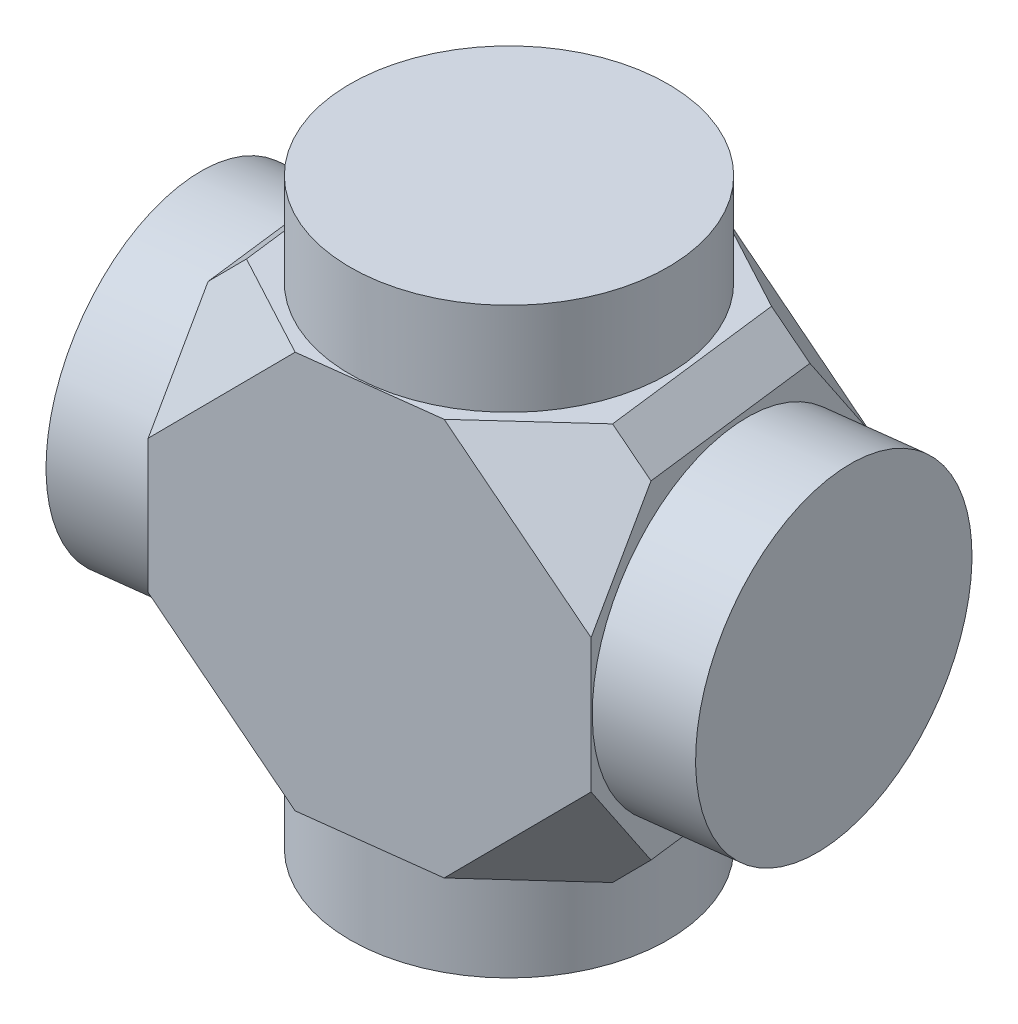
ISO-10303-21;
HEADER;
FILE_DESCRIPTION(('STEP AP214'),'2;1');
FILE_NAME('part.step','',(''),(''),'','','');
FILE_SCHEMA(('AUTOMOTIVE_DESIGN { 1 0 10303 214 1 1 1 1 }'));
ENDSEC;
DATA;
#1=APPLICATION_CONTEXT('core data for automotive mechanical design processes');
#2=APPLICATION_PROTOCOL_DEFINITION('international standard','automotive_design',2000,#1);
#3=PRODUCT_CONTEXT('',#1,'mechanical');
#4=PRODUCT('Part','Part','',(#3));
#5=PRODUCT_RELATED_PRODUCT_CATEGORY('part','',(#4));
#6=PRODUCT_DEFINITION_FORMATION('','',#4);
#7=PRODUCT_DEFINITION_CONTEXT('part definition',#1,'design');
#8=PRODUCT_DEFINITION('design','',#6,#7);
#9=PRODUCT_DEFINITION_SHAPE('','',#8);
#10=(LENGTH_UNIT() NAMED_UNIT(*) SI_UNIT(.MILLI.,.METRE.));
#11=(NAMED_UNIT(*) PLANE_ANGLE_UNIT() SI_UNIT($,.RADIAN.));
#12=(NAMED_UNIT(*) SI_UNIT($,.STERADIAN.) SOLID_ANGLE_UNIT());
#13=UNCERTAINTY_MEASURE_WITH_UNIT(LENGTH_MEASURE(1.E-05),#10,'distance_accuracy_value','');
#14=(GEOMETRIC_REPRESENTATION_CONTEXT(3) GLOBAL_UNCERTAINTY_ASSIGNED_CONTEXT((#13)) GLOBAL_UNIT_ASSIGNED_CONTEXT((#10,
#11,#12)) REPRESENTATION_CONTEXT('',''));
#15=CARTESIAN_POINT('',(0.,0.,0.));
#16=DIRECTION('',(0.,0.,1.));
#17=DIRECTION('',(1.,0.,0.));
#18=AXIS2_PLACEMENT_3D('',#15,#16,#17);
#19=CARTESIAN_POINT('',(99.9999999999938,11.,-148.379999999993));
#20=DIRECTION('',(0.,-1.,0.));
#21=DIRECTION('',(0.992460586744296,0.,-0.122564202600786));
#22=AXIS2_PLACEMENT_3D('',#19,#20,#21);
#23=CYLINDRICAL_SURFACE('',#22,6.);
#24=CARTESIAN_POINT('',(99.9999999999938,11.,-148.379999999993));
#25=DIRECTION('',(0.,1.,0.));
#26=DIRECTION('',(-0.992460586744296,0.,0.122564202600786));
#27=AXIS2_PLACEMENT_3D('',#24,#25,#26);
#28=CIRCLE('',#27,6.);
#29=CARTESIAN_POINT('',(94.045236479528,11.,-147.644614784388));
#30=VERTEX_POINT('',#29);
#31=EDGE_CURVE('E264',#30,#30,#28,.T.);
#32=ORIENTED_EDGE('',*,*,#31,.F.);
#33=EDGE_LOOP('',(#32));
#34=FACE_BOUND('',#33,.T.);
#35=CARTESIAN_POINT('',(99.9999999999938,7.5,-148.379999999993));
#36=DIRECTION('',(0.,-1.,0.));
#37=DIRECTION('',(0.992460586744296,0.,-0.122564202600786));
#38=AXIS2_PLACEMENT_3D('',#35,#36,#37);
#39=CIRCLE('',#38,6.);
#40=CARTESIAN_POINT('',(105.95476352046,7.5,-149.115385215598));
#41=VERTEX_POINT('',#40);
#42=EDGE_CURVE('E20',#41,#41,#39,.F.);
#43=ORIENTED_EDGE('',*,*,#42,.T.);
#44=EDGE_LOOP('',(#43));
#45=FACE_BOUND('',#44,.T.);
#46=ADVANCED_FACE('F16',(#34,#45),#23,.T.);
#47=CARTESIAN_POINT('',(99.9999999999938,11.,-148.379999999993));
#48=DIRECTION('',(0.,1.,0.));
#49=DIRECTION('',(-0.992460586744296,0.,0.122564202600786));
#50=AXIS2_PLACEMENT_3D('',#47,#48,#49);
#51=PLANE('',#50);
#52=ORIENTED_EDGE('',*,*,#31,.T.);
#53=EDGE_LOOP('',(#52));
#54=FACE_BOUND('',#53,.T.);
#55=ADVANCED_FACE('F344',(#54),#51,.T.);
#56=CARTESIAN_POINT('',(110.917066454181,0.,-149.728206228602));
#57=DIRECTION('',(0.992460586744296,0.,-0.122564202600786));
#58=DIRECTION('',(0.,1.,0.));
#59=AXIS2_PLACEMENT_3D('',#56,#57,#58);
#60=PLANE('',#59);
#61=CARTESIAN_POINT('',(110.917066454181,0.,-149.728206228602));
#62=DIRECTION('',(0.992460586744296,0.,-0.122564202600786));
#63=DIRECTION('',(0.,1.,0.));
#64=AXIS2_PLACEMENT_3D('',#61,#62,#63);
#65=CIRCLE('',#64,6.);
#66=CARTESIAN_POINT('',(110.917066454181,-6.,-149.728206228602));
#67=VERTEX_POINT('',#66);
#68=EDGE_CURVE('E252',#67,#67,#65,.T.);
#69=ORIENTED_EDGE('',*,*,#68,.T.);
#70=EDGE_LOOP('',(#69));
#71=FACE_BOUND('',#70,.T.);
#72=ADVANCED_FACE('F352',(#71),#60,.T.);
#73=CARTESIAN_POINT('',(89.0829335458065,0.,-147.031793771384));
#74=DIRECTION('',(0.992460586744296,0.,-0.122564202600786));
#75=DIRECTION('',(0.,1.,0.));
#76=AXIS2_PLACEMENT_3D('',#73,#74,#75);
#77=PLANE('',#76);
#78=CARTESIAN_POINT('',(89.0829335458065,0.,-147.031793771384));
#79=DIRECTION('',(0.992460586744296,0.,-0.122564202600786));
#80=DIRECTION('',(0.,1.,0.));
#81=AXIS2_PLACEMENT_3D('',#78,#79,#80);
#82=CIRCLE('',#81,6.);
#83=CARTESIAN_POINT('',(89.0829335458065,-6.,-147.031793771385));
#84=VERTEX_POINT('',#83);
#85=EDGE_CURVE('E259',#84,#84,#82,.T.);
#86=ORIENTED_EDGE('',*,*,#85,.F.);
#87=EDGE_LOOP('',(#86));
#88=FACE_BOUND('',#87,.T.);
#89=ADVANCED_FACE('F514',(#88),#77,.F.);
#90=CARTESIAN_POINT('',(110.917066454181,0.,-149.728206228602));
#91=DIRECTION('',(-0.992460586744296,0.,0.122564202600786));
#92=DIRECTION('',(0.,-1.,0.));
#93=AXIS2_PLACEMENT_3D('',#90,#91,#92);
#94=CYLINDRICAL_SURFACE('',#93,6.);
#95=CARTESIAN_POINT('',(107.443454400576,0.,-149.299231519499));
#96=DIRECTION('',(0.992460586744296,0.,-0.122564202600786));
#97=DIRECTION('',(0.,1.,0.));
#98=AXIS2_PLACEMENT_3D('',#95,#96,#97);
#99=CIRCLE('',#98,6.);
#100=CARTESIAN_POINT('',(107.443454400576,-6.,-149.299231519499));
#101=VERTEX_POINT('',#100);
#102=EDGE_CURVE('E249',#101,#101,#99,.F.);
#103=CARTESIAN_POINT('',(107.443454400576,-6.,-149.299231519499));
#104=CARTESIAN_POINT('',(107.479637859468,-6.,-149.303700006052));
#105=CARTESIAN_POINT('',(107.51582131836,-6.,-149.308168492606));
#106=CARTESIAN_POINT('',(107.588188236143,-6.,-149.317105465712));
#107=CARTESIAN_POINT('',(107.624371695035,-6.,-149.321573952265));
#108=CARTESIAN_POINT('',(107.696738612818,-6.,-149.330510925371));
#109=CARTESIAN_POINT('',(107.73292207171,-6.,-149.334979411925));
#110=CARTESIAN_POINT('',(107.805288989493,-6.,-149.343916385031));
#111=CARTESIAN_POINT('',(107.841472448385,-6.,-149.348384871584));
#112=CARTESIAN_POINT('',(107.913839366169,-6.,-149.35732184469));
#113=CARTESIAN_POINT('',(107.95002282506,-6.,-149.361790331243));
#114=CARTESIAN_POINT('',(108.022389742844,-6.,-149.37072730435));
#115=CARTESIAN_POINT('',(108.058573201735,-6.,-149.375195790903));
#116=CARTESIAN_POINT('',(108.130940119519,-6.,-149.384132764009));
#117=CARTESIAN_POINT('',(108.167123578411,-6.,-149.388601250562));
#118=CARTESIAN_POINT('',(108.239490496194,-6.,-149.397538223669));
#119=CARTESIAN_POINT('',(108.275673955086,-6.,-149.402006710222));
#120=CARTESIAN_POINT('',(108.348040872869,-6.,-149.410943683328));
#121=CARTESIAN_POINT('',(108.384224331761,-6.,-149.415412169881));
#122=CARTESIAN_POINT('',(108.456591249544,-6.,-149.424349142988));
#123=CARTESIAN_POINT('',(108.492774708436,-6.,-149.428817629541));
#124=CARTESIAN_POINT('',(108.565141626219,-6.,-149.437754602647));
#125=CARTESIAN_POINT('',(108.601325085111,-6.,-149.4422230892));
#126=CARTESIAN_POINT('',(108.673692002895,-6.,-149.451160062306));
#127=CARTESIAN_POINT('',(108.709875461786,-6.,-149.45562854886));
#128=CARTESIAN_POINT('',(108.78224237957,-6.,-149.464565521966));
#129=CARTESIAN_POINT('',(108.818425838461,-6.,-149.469034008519));
#130=CARTESIAN_POINT('',(108.890792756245,-6.,-149.477970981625));
#131=CARTESIAN_POINT('',(108.926976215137,-6.,-149.482439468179));
#132=CARTESIAN_POINT('',(108.99934313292,-6.,-149.491376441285));
#133=CARTESIAN_POINT('',(109.035526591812,-6.,-149.495844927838));
#134=CARTESIAN_POINT('',(109.107893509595,-6.,-149.504781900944));
#135=CARTESIAN_POINT('',(109.144076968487,-6.,-149.509250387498));
#136=CARTESIAN_POINT('',(109.21644388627,-6.,-149.518187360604));
#137=CARTESIAN_POINT('',(109.252627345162,-6.,-149.522655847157));
#138=CARTESIAN_POINT('',(109.324994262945,-6.,-149.531592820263));
#139=CARTESIAN_POINT('',(109.361177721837,-6.,-149.536061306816));
#140=CARTESIAN_POINT('',(109.433544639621,-6.,-149.544998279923));
#141=CARTESIAN_POINT('',(109.469728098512,-6.,-149.549466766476));
#142=CARTESIAN_POINT('',(109.542095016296,-6.,-149.558403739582));
#143=CARTESIAN_POINT('',(109.578278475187,-6.,-149.562872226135));
#144=CARTESIAN_POINT('',(109.650645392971,-6.,-149.571809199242));
#145=CARTESIAN_POINT('',(109.686828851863,-6.,-149.576277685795));
#146=CARTESIAN_POINT('',(109.759195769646,-6.,-149.585214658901));
#147=CARTESIAN_POINT('',(109.795379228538,-6.,-149.589683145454));
#148=CARTESIAN_POINT('',(109.867746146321,-6.,-149.598620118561));
#149=CARTESIAN_POINT('',(109.903929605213,-6.,-149.603088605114));
#150=CARTESIAN_POINT('',(109.976296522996,-6.,-149.61202557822));
#151=CARTESIAN_POINT('',(110.012479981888,-6.,-149.616494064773));
#152=CARTESIAN_POINT('',(110.084846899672,-6.,-149.625431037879));
#153=CARTESIAN_POINT('',(110.121030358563,-6.,-149.629899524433));
#154=CARTESIAN_POINT('',(110.193397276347,-6.,-149.638836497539));
#155=CARTESIAN_POINT('',(110.229580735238,-6.,-149.643304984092));
#156=CARTESIAN_POINT('',(110.301947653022,-6.,-149.652241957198));
#157=CARTESIAN_POINT('',(110.338131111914,-6.,-149.656710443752));
#158=CARTESIAN_POINT('',(110.410498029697,-6.,-149.665647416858));
#159=CARTESIAN_POINT('',(110.446681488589,-6.,-149.670115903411));
#160=CARTESIAN_POINT('',(110.519048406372,-6.,-149.679052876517));
#161=CARTESIAN_POINT('',(110.555231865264,-6.,-149.68352136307));
#162=CARTESIAN_POINT('',(110.627598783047,-6.,-149.692458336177));
#163=CARTESIAN_POINT('',(110.663782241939,-6.,-149.69692682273));
#164=CARTESIAN_POINT('',(110.736149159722,-6.,-149.705863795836));
#165=CARTESIAN_POINT('',(110.772332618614,-6.,-149.710332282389));
#166=CARTESIAN_POINT('',(110.844699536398,-6.,-149.719269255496));
#167=CARTESIAN_POINT('',(110.880882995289,-6.,-149.723737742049));
#168=CARTESIAN_POINT('',(110.917066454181,-6.,-149.728206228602));
#169=B_SPLINE_CURVE_WITH_KNOTS('',3,(#103,#104,#105,#106,#107,#108,#109,#110,#111,#112,#113,
#114,#115,#116,#117,#118,#119,#120,#121,#122,#123,#124,#125,#126,#127,#128,#129,#130,#131,#132,
#133,#134,#135,#136,#137,#138,#139,#140,#141,#142,#143,#144,#145,#146,#147,#148,#149,#150,#151,
#152,#153,#154,#155,#156,#157,#158,#159,#160,#161,#162,#163,#164,#165,#166,#167,#168),
.UNSPECIFIED.,.F.,.F.,(4,2,2,2,2,2,2,2,2,2,2,2,2,2,2,2,2,2,2,2,2,2,2,2,2,2,2,2,2,2,2,2,4),(0.,
0.109374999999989,0.218749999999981,0.328124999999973,0.437499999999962,0.546874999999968,
0.656249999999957,0.765624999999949,0.874999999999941,0.98437499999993,1.09374999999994,
1.20312499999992,1.31249999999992,1.42187499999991,1.53124999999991,1.6406249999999,
1.74999999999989,1.85937499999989,1.96874999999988,2.07812499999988,2.18749999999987,
2.29687499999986,2.40624999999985,2.51562499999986,2.62499999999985,2.73437499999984,
2.84374999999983,2.95312499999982,3.06249999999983,3.17187499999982,3.28124999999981,
3.3906249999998,3.49999999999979),.UNSPECIFIED.);
#170=EDGE_CURVE('BSEAM520',#101,#67,#169,.T.);
#171=ORIENTED_EDGE('',*,*,#102,.F.);
#172=ORIENTED_EDGE('',*,*,#68,.F.);
#173=ORIENTED_EDGE('',*,*,#170,.T.);
#174=ORIENTED_EDGE('',*,*,#170,.F.);
#175=EDGE_LOOP('',(#171,#173,#172,#174));
#176=FACE_BOUND('',#175,.T.);
#177=ADVANCED_FACE('F520',(#176),#94,.T.);
#178=CARTESIAN_POINT('',(92.5565455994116,0.,-147.460768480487));
#179=DIRECTION('',(0.992460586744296,0.,-0.122564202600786));
#180=DIRECTION('',(0.,1.,0.));
#181=AXIS2_PLACEMENT_3D('',#178,#179,#180);
#182=CIRCLE('',#181,6.);
#183=CARTESIAN_POINT('',(92.5565455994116,-6.,-147.460768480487));
#184=VERTEX_POINT('',#183);
#185=EDGE_CURVE('E248',#184,#184,#182,.F.);
#186=CARTESIAN_POINT('',(89.0829335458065,-6.,-147.031793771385));
#187=CARTESIAN_POINT('',(89.1191170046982,-6.,-147.036262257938));
#188=CARTESIAN_POINT('',(89.1553004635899,-6.,-147.040730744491));
#189=CARTESIAN_POINT('',(89.2276673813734,-6.,-147.049667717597));
#190=CARTESIAN_POINT('',(89.2638508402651,-6.,-147.05413620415));
#191=CARTESIAN_POINT('',(89.3362177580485,-6.,-147.063073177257));
#192=CARTESIAN_POINT('',(89.3724012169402,-6.,-147.06754166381));
#193=CARTESIAN_POINT('',(89.4447681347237,-6.,-147.076478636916));
#194=CARTESIAN_POINT('',(89.4809515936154,-6.,-147.080947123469));
#195=CARTESIAN_POINT('',(89.5533185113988,-6.,-147.089884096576));
#196=CARTESIAN_POINT('',(89.5895019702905,-6.,-147.094352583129));
#197=CARTESIAN_POINT('',(89.661868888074,-6.,-147.103289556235));
#198=CARTESIAN_POINT('',(89.6980523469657,-6.,-147.107758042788));
#199=CARTESIAN_POINT('',(89.7704192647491,-6.,-147.116695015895));
#200=CARTESIAN_POINT('',(89.8066027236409,-6.,-147.121163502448));
#201=CARTESIAN_POINT('',(89.8789696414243,-6.,-147.130100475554));
#202=CARTESIAN_POINT('',(89.915153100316,-6.,-147.134568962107));
#203=CARTESIAN_POINT('',(89.9875200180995,-6.,-147.143505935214));
#204=CARTESIAN_POINT('',(90.0237034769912,-6.,-147.147974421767));
#205=CARTESIAN_POINT('',(90.0960703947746,-6.,-147.156911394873));
#206=CARTESIAN_POINT('',(90.1322538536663,-6.,-147.161379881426));
#207=CARTESIAN_POINT('',(90.2046207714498,-6.,-147.170316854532));
#208=CARTESIAN_POINT('',(90.2408042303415,-6.,-147.174785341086));
#209=CARTESIAN_POINT('',(90.313171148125,-6.,-147.183722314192));
#210=CARTESIAN_POINT('',(90.3493546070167,-6.,-147.188190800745));
#211=CARTESIAN_POINT('',(90.4217215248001,-6.,-147.197127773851));
#212=CARTESIAN_POINT('',(90.4579049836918,-6.,-147.201596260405));
#213=CARTESIAN_POINT('',(90.5302719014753,-6.,-147.210533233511));
#214=CARTESIAN_POINT('',(90.566455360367,-6.,-147.215001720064));
#215=CARTESIAN_POINT('',(90.6388222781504,-6.,-147.22393869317));
#216=CARTESIAN_POINT('',(90.6750057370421,-6.,-147.228407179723));
#217=CARTESIAN_POINT('',(90.7473726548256,-6.,-147.23734415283));
#218=CARTESIAN_POINT('',(90.7835561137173,-6.,-147.241812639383));
#219=CARTESIAN_POINT('',(90.8559230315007,-6.,-147.250749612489));
#220=CARTESIAN_POINT('',(90.8921064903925,-6.,-147.255218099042));
#221=CARTESIAN_POINT('',(90.9644734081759,-6.,-147.264155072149));
#222=CARTESIAN_POINT('',(91.0006568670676,-6.,-147.268623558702));
#223=CARTESIAN_POINT('',(91.0730237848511,-6.,-147.277560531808));
#224=CARTESIAN_POINT('',(91.1092072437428,-6.,-147.282029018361));
#225=CARTESIAN_POINT('',(91.1815741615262,-6.,-147.290965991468));
#226=CARTESIAN_POINT('',(91.2177576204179,-6.,-147.295434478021));
#227=CARTESIAN_POINT('',(91.2901245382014,-6.,-147.304371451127));
#228=CARTESIAN_POINT('',(91.3263079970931,-6.,-147.30883993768));
#229=CARTESIAN_POINT('',(91.3986749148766,-6.,-147.317776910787));
#230=CARTESIAN_POINT('',(91.4348583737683,-6.,-147.32224539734));
#231=CARTESIAN_POINT('',(91.5072252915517,-6.,-147.331182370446));
#232=CARTESIAN_POINT('',(91.5434087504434,-6.,-147.335650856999));
#233=CARTESIAN_POINT('',(91.6157756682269,-6.,-147.344587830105));
#234=CARTESIAN_POINT('',(91.6519591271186,-6.,-147.349056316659));
#235=CARTESIAN_POINT('',(91.724326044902,-6.,-147.357993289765));
#236=CARTESIAN_POINT('',(91.7605095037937,-6.,-147.362461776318));
#237=CARTESIAN_POINT('',(91.8328764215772,-6.,-147.371398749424));
#238=CARTESIAN_POINT('',(91.8690598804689,-6.,-147.375867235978));
#239=CARTESIAN_POINT('',(91.9414267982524,-6.,-147.384804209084));
#240=CARTESIAN_POINT('',(91.9776102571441,-6.,-147.389272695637));
#241=CARTESIAN_POINT('',(92.0499771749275,-6.,-147.398209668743));
#242=CARTESIAN_POINT('',(92.0861606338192,-6.,-147.402678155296));
#243=CARTESIAN_POINT('',(92.1585275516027,-6.,-147.411615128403));
#244=CARTESIAN_POINT('',(92.1947110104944,-6.,-147.416083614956));
#245=CARTESIAN_POINT('',(92.2670779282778,-6.,-147.425020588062));
#246=CARTESIAN_POINT('',(92.3032613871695,-6.,-147.429489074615));
#247=CARTESIAN_POINT('',(92.375628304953,-6.,-147.438426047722));
#248=CARTESIAN_POINT('',(92.4118117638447,-6.,-147.442894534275));
#249=CARTESIAN_POINT('',(92.4841786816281,-6.,-147.451831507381));
#250=CARTESIAN_POINT('',(92.5203621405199,-6.,-147.456299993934));
#251=CARTESIAN_POINT('',(92.5565455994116,-6.,-147.460768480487));
#252=B_SPLINE_CURVE_WITH_KNOTS('',3,(#186,#187,#188,#189,#190,#191,#192,#193,#194,#195,#196,
#197,#198,#199,#200,#201,#202,#203,#204,#205,#206,#207,#208,#209,#210,#211,#212,#213,#214,#215,
#216,#217,#218,#219,#220,#221,#222,#223,#224,#225,#226,#227,#228,#229,#230,#231,#232,#233,#234,
#235,#236,#237,#238,#239,#240,#241,#242,#243,#244,#245,#246,#247,#248,#249,#250,#251),
.UNSPECIFIED.,.F.,.F.,(4,2,2,2,2,2,2,2,2,2,2,2,2,2,2,2,2,2,2,2,2,2,2,2,2,2,2,2,2,2,2,2,4),(0.,
0.109375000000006,0.218749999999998,0.328125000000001,0.437500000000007,0.546875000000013,
0.656250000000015,0.765625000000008,0.87500000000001,0.984375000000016,1.09375000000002,
1.20312500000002,1.31250000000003,1.42187500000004,1.53125000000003,1.64062500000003,
1.75000000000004,1.85937500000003,1.96875000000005,2.07812500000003,2.18750000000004,
2.29687500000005,2.40625000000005,2.51562500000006,2.62500000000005,2.73437500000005,
2.84375000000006,2.95312500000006,3.06250000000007,3.17187500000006,3.28125000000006,
3.39062500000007,3.50000000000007),.UNSPECIFIED.);
#253=EDGE_CURVE('BSEAM529',#84,#184,#252,.T.);
#254=ORIENTED_EDGE('',*,*,#85,.T.);
#255=ORIENTED_EDGE('',*,*,#185,.T.);
#256=ORIENTED_EDGE('',*,*,#253,.T.);
#257=ORIENTED_EDGE('',*,*,#253,.F.);
#258=EDGE_LOOP('',(#254,#256,#255,#257));
#259=FACE_BOUND('',#258,.T.);
#260=ADVANCED_FACE('F529',(#259),#94,.T.);
#261=CARTESIAN_POINT('',(108.184967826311,-7.5,-143.294844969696));
#262=DIRECTION('',(0.992460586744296,0.,-0.122564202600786));
#263=DIRECTION('',(0.,1.,0.));
#264=AXIS2_PLACEMENT_3D('',#261,#262,#263);
#265=PLANE('',#264);
#266=ORIENTED_EDGE('',*,*,#102,.T.);
#267=EDGE_LOOP('',(#266));
#268=FACE_BOUND('',#267,.T.);
#269=DIRECTION('',(-0.122564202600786,0.,-0.992460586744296));
#270=VECTOR('',#269,1.);
#271=CARTESIAN_POINT('',(106.701940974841,-6.2,-155.303618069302));
#272=LINE('',#271,#270);
#273=CARTESIAN_POINT('',(107.866300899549,-6.2,-145.875242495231));
#274=VERTEX_POINT('',#273);
#275=CARTESIAN_POINT('',(107.020607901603,-6.2,-152.723220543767));
#276=VERTEX_POINT('',#275);
#277=EDGE_CURVE('E182',#274,#276,#272,.T.);
#278=ORIENTED_EDGE('',*,*,#277,.T.);
#279=DIRECTION('',(-0.0707624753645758,0.816496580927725,-0.572997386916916));
#280=VECTOR('',#279,1.);
#281=CARTESIAN_POINT('',(107.483838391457,-11.5450096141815,-148.972223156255));
#282=LINE('',#281,#280);
#283=CARTESIAN_POINT('',(106.701940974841,-2.52304473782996,-155.303618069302));
#284=VERTEX_POINT('',#283);
#285=EDGE_CURVE('E232',#276,#284,#282,.T.);
#286=ORIENTED_EDGE('',*,*,#285,.T.);
#287=DIRECTION('',(0.,1.,0.));
#288=VECTOR('',#287,1.);
#289=CARTESIAN_POINT('',(106.701940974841,-7.5,-155.303618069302));
#290=LINE('',#289,#288);
#291=CARTESIAN_POINT('',(106.701940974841,2.52304473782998,-155.303618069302));
#292=VERTEX_POINT('',#291);
#293=EDGE_CURVE('E153',#284,#292,#290,.T.);
#294=ORIENTED_EDGE('',*,*,#293,.T.);
#295=DIRECTION('',(0.0707624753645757,0.816496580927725,0.572997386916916));
#296=VECTOR('',#295,1.);
#297=CARTESIAN_POINT('',(106.61717860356,1.5450096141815,-155.989979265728));
#298=LINE('',#297,#296);
#299=CARTESIAN_POINT('',(107.020607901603,6.2,-152.723220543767));
#300=VERTEX_POINT('',#299);
#301=EDGE_CURVE('E39',#292,#300,#298,.T.);
#302=ORIENTED_EDGE('',*,*,#301,.T.);
#303=DIRECTION('',(0.122564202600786,0.,0.992460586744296));
#304=VECTOR('',#303,1.);
#305=CARTESIAN_POINT('',(108.184967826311,6.2,-143.294844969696));
#306=LINE('',#305,#304);
#307=CARTESIAN_POINT('',(107.866300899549,6.2,-145.875242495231));
#308=VERTEX_POINT('',#307);
#309=EDGE_CURVE('E180',#300,#308,#306,.T.);
#310=ORIENTED_EDGE('',*,*,#309,.T.);
#311=DIRECTION('',(0.0707624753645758,-0.816496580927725,0.572997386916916));
#312=VECTOR('',#311,1.);
#313=CARTESIAN_POINT('',(108.764072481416,-4.15898508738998,-138.605559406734));
#314=LINE('',#313,#312);
#315=CARTESIAN_POINT('',(108.184967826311,2.52304473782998,-143.294844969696));
#316=VERTEX_POINT('',#315);
#317=EDGE_CURVE('E227',#308,#316,#314,.T.);
#318=ORIENTED_EDGE('',*,*,#317,.T.);
#319=DIRECTION('',(0.,-1.,0.));
#320=VECTOR('',#319,1.);
#321=CARTESIAN_POINT('',(108.184967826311,7.5,-143.294844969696));
#322=LINE('',#321,#320);
#323=CARTESIAN_POINT('',(108.184967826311,-2.52304473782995,-143.294844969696));
#324=VERTEX_POINT('',#323);
#325=EDGE_CURVE('E271',#316,#324,#322,.T.);
#326=ORIENTED_EDGE('',*,*,#325,.T.);
#327=DIRECTION('',(-0.0707624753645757,-0.816496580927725,-0.572997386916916));
#328=VECTOR('',#327,1.);
#329=CARTESIAN_POINT('',(107.897412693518,-5.84101491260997,-145.623315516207));
#330=LINE('',#329,#328);
#331=EDGE_CURVE('E229',#324,#274,#330,.T.);
#332=ORIENTED_EDGE('',*,*,#331,.T.);
#333=EDGE_LOOP('',(#278,#286,#294,#302,#310,#318,#326,#332));
#334=FACE_BOUND('',#333,.T.);
#335=ADVANCED_FACE('F318',(#268,#334),#265,.T.);
#336=CARTESIAN_POINT('',(93.2980590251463,-7.5,-141.456381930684));
#337=DIRECTION('',(0.992460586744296,0.,-0.122564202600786));
#338=DIRECTION('',(0.,1.,0.));
#339=AXIS2_PLACEMENT_3D('',#336,#337,#338);
#340=PLANE('',#339);
#341=ORIENTED_EDGE('',*,*,#185,.F.);
#342=EDGE_LOOP('',(#341));
#343=FACE_BOUND('',#342,.T.);
#344=DIRECTION('',(-0.122564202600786,0.,-0.992460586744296));
#345=VECTOR('',#344,1.);
#346=CARTESIAN_POINT('',(93.2980590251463,6.2,-141.456381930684));
#347=LINE('',#346,#345);
#348=CARTESIAN_POINT('',(92.9793920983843,6.2,-144.036779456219));
#349=VERTEX_POINT('',#348);
#350=CARTESIAN_POINT('',(92.1336991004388,6.2,-150.884757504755));
#351=VERTEX_POINT('',#350);
#352=EDGE_CURVE('E174',#349,#351,#347,.T.);
#353=ORIENTED_EDGE('',*,*,#352,.T.);
#354=DIRECTION('',(0.0707624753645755,0.816496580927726,0.572997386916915));
#355=VECTOR('',#354,1.);
#356=CARTESIAN_POINT('',(91.9588097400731,4.18202982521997,-152.300919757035));
#357=LINE('',#356,#355);
#358=CARTESIAN_POINT('',(91.8150321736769,2.52304473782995,-153.46515503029));
#359=VERTEX_POINT('',#358);
#360=EDGE_CURVE('E214',#351,#359,#357,.F.);
#361=ORIENTED_EDGE('',*,*,#360,.T.);
#362=DIRECTION('',(0.,1.,0.));
#363=VECTOR('',#362,1.);
#364=CARTESIAN_POINT('',(91.8150321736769,-7.5,-153.46515503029));
#365=LINE('',#364,#363);
#366=CARTESIAN_POINT('',(91.8150321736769,-2.52304473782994,-153.46515503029));
#367=VERTEX_POINT('',#366);
#368=EDGE_CURVE('E256',#367,#359,#365,.T.);
#369=ORIENTED_EDGE('',*,*,#368,.F.);
#370=DIRECTION('',(-0.0707624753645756,0.816496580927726,-0.572997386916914));
#371=VECTOR('',#370,1.);
#372=CARTESIAN_POINT('',(92.3921396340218,-9.18202982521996,-148.792041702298));
#373=LINE('',#372,#371);
#374=CARTESIAN_POINT('',(92.1336991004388,-6.2,-150.884757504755));
#375=VERTEX_POINT('',#374);
#376=EDGE_CURVE('E212',#367,#375,#373,.F.);
#377=ORIENTED_EDGE('',*,*,#376,.T.);
#378=DIRECTION('',(0.122564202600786,0.,0.992460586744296));
#379=VECTOR('',#378,1.);
#380=CARTESIAN_POINT('',(93.2980590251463,-6.2,-141.456381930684));
#381=LINE('',#380,#379);
#382=CARTESIAN_POINT('',(92.9793920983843,-6.2,-144.036779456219));
#383=VERTEX_POINT('',#382);
#384=EDGE_CURVE('E177',#375,#383,#381,.T.);
#385=ORIENTED_EDGE('',*,*,#384,.T.);
#386=DIRECTION('',(-0.0707624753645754,-0.816496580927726,-0.572997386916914));
#387=VECTOR('',#386,1.);
#388=CARTESIAN_POINT('',(93.1542814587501,-4.18202982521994,-142.62061720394));
#389=LINE('',#388,#387);
#390=CARTESIAN_POINT('',(93.2980590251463,-2.52304473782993,-141.456381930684));
#391=VERTEX_POINT('',#390);
#392=EDGE_CURVE('E210',#383,#391,#389,.F.);
#393=ORIENTED_EDGE('',*,*,#392,.T.);
#394=DIRECTION('',(0.,-1.,0.));
#395=VECTOR('',#394,1.);
#396=CARTESIAN_POINT('',(93.2980590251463,7.5,-141.456381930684));
#397=LINE('',#396,#395);
#398=CARTESIAN_POINT('',(93.2980590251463,2.52304473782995,-141.456381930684));
#399=VERTEX_POINT('',#398);
#400=EDGE_CURVE('E251',#399,#391,#397,.T.);
#401=ORIENTED_EDGE('',*,*,#400,.F.);
#402=DIRECTION('',(0.0707624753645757,-0.816496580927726,0.572997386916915));
#403=VECTOR('',#402,1.);
#404=CARTESIAN_POINT('',(92.7209515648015,9.18202982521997,-146.129495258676));
#405=LINE('',#404,#403);
#406=EDGE_CURVE('E208',#399,#349,#405,.F.);
#407=ORIENTED_EDGE('',*,*,#406,.T.);
#408=EDGE_LOOP('',(#353,#361,#369,#377,#385,#393,#401,#407));
#409=FACE_BOUND('',#408,.T.);
#410=ADVANCED_FACE('F290',(#343,#409),#340,.F.);
#411=CARTESIAN_POINT('',(95.767774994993,-5.01152236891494,-141.761380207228));
#412=DIRECTION('',(0.409564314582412,0.5,-0.763057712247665));
#413=DIRECTION('',(0.70177561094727,-0.70710678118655,-0.0866659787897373));
#414=AXIS2_PLACEMENT_3D('',#411,#412,#413);
#415=PLANE('',#414);
#416=ORIENTED_EDGE('',*,*,#392,.F.);
#417=DIRECTION('',(0.70177561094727,-0.70710678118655,-0.0866659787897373));
#418=VECTOR('',#417,1.);
#419=CARTESIAN_POINT('',(92.9793920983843,-6.2,-144.036779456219));
#420=LINE('',#419,#418);
#421=CARTESIAN_POINT('',(94.2695908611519,-7.5,-144.1961129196));
#422=VERTEX_POINT('',#421);
#423=EDGE_CURVE('E216',#422,#383,#420,.F.);
#424=ORIENTED_EDGE('',*,*,#423,.F.);
#425=DIRECTION('',(0.881103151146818,0.,0.472924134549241));
#426=VECTOR('',#425,1.);
#427=CARTESIAN_POINT('',(96.4472360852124,-7.5,-143.027281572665));
#428=LINE('',#427,#426);
#429=CARTESIAN_POINT('',(98.2374909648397,-7.5,-142.066378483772));
#430=VERTEX_POINT('',#429);
#431=EDGE_CURVE('E220',#430,#422,#428,.F.);
#432=ORIENTED_EDGE('',*,*,#431,.F.);
#433=DIRECTION('',(0.70177561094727,-0.70710678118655,-0.0866659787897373));
#434=VECTOR('',#433,1.);
#435=CARTESIAN_POINT('',(96.4128743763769,-5.66152236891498,-141.841046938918));
#436=LINE('',#435,#434);
#437=EDGE_CURVE('E243',#391,#430,#436,.T.);
#438=ORIENTED_EDGE('',*,*,#437,.F.);
#439=EDGE_LOOP('',(#416,#424,#432,#438));
#440=FACE_BOUND('',#439,.T.);
#441=ADVANCED_FACE('F311',(#440),#415,.F.);
#442=CARTESIAN_POINT('',(113.158706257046,2.48847763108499,-143.909078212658));
#443=DIRECTION('',(0.582896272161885,-0.5,0.640493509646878));
#444=DIRECTION('',(-0.701775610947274,-0.707106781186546,0.0866659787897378));
#445=AXIS2_PLACEMENT_3D('',#442,#443,#444);
#446=PLANE('',#445);
#447=DIRECTION('',(-0.739578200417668,0.,0.673070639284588));
#448=VECTOR('',#447,1.);
#449=CARTESIAN_POINT('',(109.277208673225,-7.5,-148.174114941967));
#450=LINE('',#449,#448);
#451=CARTESIAN_POINT('',(106.576102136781,-7.5,-145.71590903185));
#452=VERTEX_POINT('',#451);
#453=CARTESIAN_POINT('',(103.245535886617,-7.5,-142.684848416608));
#454=VERTEX_POINT('',#453);
#455=EDGE_CURVE('E142',#452,#454,#450,.T.);
#456=ORIENTED_EDGE('',*,*,#455,.F.);
#457=DIRECTION('',(-0.701775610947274,-0.707106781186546,0.0866659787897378));
#458=VECTOR('',#457,1.);
#459=CARTESIAN_POINT('',(106.576102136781,-7.5,-145.71590903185));
#460=LINE('',#459,#458);
#461=EDGE_CURVE('E224',#274,#452,#460,.T.);
#462=ORIENTED_EDGE('',*,*,#461,.F.);
#463=ORIENTED_EDGE('',*,*,#331,.F.);
#464=DIRECTION('',(0.701775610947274,0.707106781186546,-0.0866659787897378));
#465=VECTOR('',#464,1.);
#466=CARTESIAN_POINT('',(106.360351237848,-4.36152236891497,-143.069513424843));
#467=LINE('',#466,#465);
#468=EDGE_CURVE('E246',#454,#324,#467,.T.);
#469=ORIENTED_EDGE('',*,*,#468,.F.);
#470=EDGE_LOOP('',(#456,#462,#463,#469));
#471=FACE_BOUND('',#470,.T.);
#472=ADVANCED_FACE('F317',(#471),#446,.T.);
#473=CARTESIAN_POINT('',(108.184967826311,-6.2,-143.294844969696));
#474=DIRECTION('',(0.70177561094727,-0.707106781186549,-0.0866659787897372));
#475=DIRECTION('',(0.122564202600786,0.,0.992460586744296));
#476=AXIS2_PLACEMENT_3D('',#473,#474,#475);
#477=PLANE('',#476);
#478=DIRECTION('',(0.122564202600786,0.,0.992460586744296));
#479=VECTOR('',#478,1.);
#480=CARTESIAN_POINT('',(106.894769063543,-7.5,-143.135511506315));
#481=LINE('',#480,#479);
#482=CARTESIAN_POINT('',(105.730409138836,-7.5,-152.563887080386));
#483=VERTEX_POINT('',#482);
#484=EDGE_CURVE('E164',#483,#452,#481,.T.);
#485=ORIENTED_EDGE('',*,*,#484,.F.);
#486=DIRECTION('',(0.701775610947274,0.707106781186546,-0.0866659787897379));
#487=VECTOR('',#486,1.);
#488=CARTESIAN_POINT('',(107.020607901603,-6.2,-152.723220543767));
#489=LINE('',#488,#487);
#490=EDGE_CURVE('E136',#483,#276,#489,.T.);
#491=ORIENTED_EDGE('',*,*,#490,.T.);
#492=ORIENTED_EDGE('',*,*,#277,.F.);
#493=ORIENTED_EDGE('',*,*,#461,.T.);
#494=EDGE_LOOP('',(#485,#491,#492,#493));
#495=FACE_BOUND('',#494,.T.);
#496=ADVANCED_FACE('F330',(#495),#477,.T.);
#497=CARTESIAN_POINT('',(104.232225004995,-5.01152236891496,-154.998619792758));
#498=DIRECTION('',(0.40956431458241,-0.5,-0.763057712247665));
#499=DIRECTION('',(0.701775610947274,0.707106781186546,-0.0866659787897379));
#500=AXIS2_PLACEMENT_3D('',#497,#498,#499);
#501=PLANE('',#500);
#502=ORIENTED_EDGE('',*,*,#285,.F.);
#503=ORIENTED_EDGE('',*,*,#490,.F.);
#504=DIRECTION('',(0.881103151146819,0.,0.472924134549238));
#505=VECTOR('',#504,1.);
#506=CARTESIAN_POINT('',(103.552763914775,-7.5,-153.732718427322));
#507=LINE('',#506,#505);
#508=CARTESIAN_POINT('',(101.762509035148,-7.5,-154.693621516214));
#509=VERTEX_POINT('',#508);
#510=EDGE_CURVE('E131',#509,#483,#507,.T.);
#511=ORIENTED_EDGE('',*,*,#510,.F.);
#512=DIRECTION('',(-0.701775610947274,-0.707106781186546,0.0866659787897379));
#513=VECTOR('',#512,1.);
#514=CARTESIAN_POINT('',(103.587125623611,-5.66152236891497,-154.918953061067));
#515=LINE('',#514,#513);
#516=EDGE_CURVE('E135',#284,#509,#515,.T.);
#517=ORIENTED_EDGE('',*,*,#516,.F.);
#518=EDGE_LOOP('',(#502,#503,#511,#517));
#519=FACE_BOUND('',#518,.T.);
#520=ADVANCED_FACE('F134',(#519),#501,.T.);
#521=CARTESIAN_POINT('',(101.728202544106,-12.511522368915,-154.68938482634));
#522=DIRECTION('',(0.582896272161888,0.5,0.640493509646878));
#523=DIRECTION('',(-0.70177561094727,0.70710678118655,0.0866659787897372));
#524=AXIS2_PLACEMENT_3D('',#521,#522,#523);
#525=PLANE('',#524);
#526=DIRECTION('',(-0.739578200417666,0.,0.67307063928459));
#527=VECTOR('',#526,1.);
#528=CARTESIAN_POINT('',(99.7807374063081,-7.5,-156.8292831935));
#529=LINE('',#528,#527);
#530=CARTESIAN_POINT('',(93.4238978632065,-7.5,-151.044090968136));
#531=VERTEX_POINT('',#530);
#532=CARTESIAN_POINT('',(96.7544641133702,-7.5,-154.075151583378));
#533=VERTEX_POINT('',#532);
#534=EDGE_CURVE('E141',#531,#533,#529,.F.);
#535=ORIENTED_EDGE('',*,*,#534,.F.);
#536=DIRECTION('',(-0.70177561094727,0.70710678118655,0.0866659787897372));
#537=VECTOR('',#536,1.);
#538=CARTESIAN_POINT('',(93.4238978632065,-7.5,-151.044090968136));
#539=LINE('',#538,#537);
#540=EDGE_CURVE('E218',#375,#531,#539,.F.);
#541=ORIENTED_EDGE('',*,*,#540,.F.);
#542=ORIENTED_EDGE('',*,*,#376,.F.);
#543=DIRECTION('',(-0.70177561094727,0.70710678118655,0.0866659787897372));
#544=VECTOR('',#543,1.);
#545=CARTESIAN_POINT('',(93.6396487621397,-4.36152236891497,-153.690486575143));
#546=LINE('',#545,#544);
#547=EDGE_CURVE('E154',#533,#367,#546,.T.);
#548=ORIENTED_EDGE('',*,*,#547,.F.);
#549=EDGE_LOOP('',(#535,#541,#542,#548));
#550=FACE_BOUND('',#549,.T.);
#551=ADVANCED_FACE('F302',(#550),#525,.F.);
#552=CARTESIAN_POINT('',(94.5882577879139,-7.5,-141.615715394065));
#553=DIRECTION('',(0.701775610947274,0.707106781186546,-0.0866659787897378));
#554=DIRECTION('',(-0.122564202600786,0.,-0.992460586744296));
#555=AXIS2_PLACEMENT_3D('',#552,#553,#554);
#556=PLANE('',#555);
#557=ORIENTED_EDGE('',*,*,#384,.F.);
#558=ORIENTED_EDGE('',*,*,#540,.T.);
#559=DIRECTION('',(-0.122564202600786,0.,-0.992460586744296));
#560=VECTOR('',#559,1.);
#561=CARTESIAN_POINT('',(94.5882577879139,-7.5,-141.615715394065));
#562=LINE('',#561,#560);
#563=EDGE_CURVE('E172',#422,#531,#562,.T.);
#564=ORIENTED_EDGE('',*,*,#563,.F.);
#565=ORIENTED_EDGE('',*,*,#423,.T.);
#566=EDGE_LOOP('',(#557,#558,#564,#565));
#567=FACE_BOUND('',#566,.T.);
#568=ADVANCED_FACE('F307',(#567),#556,.F.);
#569=CARTESIAN_POINT('',(111.675679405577,-2.48847763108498,-155.917851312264));
#570=DIRECTION('',(0.40956431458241,0.5,-0.763057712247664));
#571=DIRECTION('',(-0.701775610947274,0.707106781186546,0.0866659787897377));
#572=AXIS2_PLACEMENT_3D('',#569,#570,#571);
#573=PLANE('',#572);
#574=DIRECTION('',(-0.881103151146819,0.,-0.472924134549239));
#575=VECTOR('',#574,1.);
#576=CARTESIAN_POINT('',(108.948396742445,7.5,-150.836661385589));
#577=LINE('',#576,#575);
#578=CARTESIAN_POINT('',(105.730409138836,7.5,-152.563887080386));
#579=VERTEX_POINT('',#578);
#580=CARTESIAN_POINT('',(101.762509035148,7.5,-154.693621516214));
#581=VERTEX_POINT('',#580);
#582=EDGE_CURVE('E200',#579,#581,#577,.T.);
#583=ORIENTED_EDGE('',*,*,#582,.F.);
#584=DIRECTION('',(-0.701775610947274,0.707106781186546,0.0866659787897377));
#585=VECTOR('',#584,1.);
#586=CARTESIAN_POINT('',(105.730409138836,7.5,-152.563887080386));
#587=LINE('',#586,#585);
#588=EDGE_CURVE('E235',#300,#579,#587,.T.);
#589=ORIENTED_EDGE('',*,*,#588,.F.);
#590=ORIENTED_EDGE('',*,*,#301,.F.);
#591=DIRECTION('',(0.701775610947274,-0.707106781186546,-0.0866659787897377));
#592=VECTOR('',#591,1.);
#593=CARTESIAN_POINT('',(104.877324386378,4.36152236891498,-155.078286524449));
#594=LINE('',#593,#592);
#595=EDGE_CURVE('E155',#581,#292,#594,.T.);
#596=ORIENTED_EDGE('',*,*,#595,.F.);
#597=EDGE_LOOP('',(#583,#589,#590,#596));
#598=FACE_BOUND('',#597,.T.);
#599=ADVANCED_FACE('F327',(#598),#573,.T.);
#600=CARTESIAN_POINT('',(108.184967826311,6.2,-143.294844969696));
#601=DIRECTION('',(0.70177561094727,0.707106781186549,-0.0866659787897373));
#602=DIRECTION('',(-0.122564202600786,0.,-0.992460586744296));
#603=AXIS2_PLACEMENT_3D('',#600,#601,#602);
#604=PLANE('',#603);
#605=ORIENTED_EDGE('',*,*,#309,.F.);
#606=ORIENTED_EDGE('',*,*,#588,.T.);
#607=DIRECTION('',(-0.122564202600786,0.,-0.992460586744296));
#608=VECTOR('',#607,1.);
#609=CARTESIAN_POINT('',(105.411742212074,7.5,-155.144284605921));
#610=LINE('',#609,#608);
#611=CARTESIAN_POINT('',(106.576102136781,7.5,-145.71590903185));
#612=VERTEX_POINT('',#611);
#613=EDGE_CURVE('E185',#612,#579,#610,.T.);
#614=ORIENTED_EDGE('',*,*,#613,.F.);
#615=DIRECTION('',(0.701775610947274,-0.707106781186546,-0.0866659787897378));
#616=VECTOR('',#615,1.);
#617=CARTESIAN_POINT('',(107.866300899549,6.2,-145.875242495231));
#618=LINE('',#617,#616);
#619=EDGE_CURVE('E32',#612,#308,#618,.T.);
#620=ORIENTED_EDGE('',*,*,#619,.T.);
#621=EDGE_LOOP('',(#605,#606,#614,#620));
#622=FACE_BOUND('',#621,.T.);
#623=ADVANCED_FACE('F324',(#622),#604,.T.);
#624=CARTESIAN_POINT('',(105.715251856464,5.01152236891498,-142.989846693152));
#625=DIRECTION('',(0.582896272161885,0.5,0.640493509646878));
#626=DIRECTION('',(0.701775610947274,-0.707106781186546,-0.0866659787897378));
#627=AXIS2_PLACEMENT_3D('',#624,#625,#626);
#628=PLANE('',#627);
#629=ORIENTED_EDGE('',*,*,#317,.F.);
#630=ORIENTED_EDGE('',*,*,#619,.F.);
#631=DIRECTION('',(0.739578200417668,0.,-0.673070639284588));
#632=VECTOR('',#631,1.);
#633=CARTESIAN_POINT('',(104.748235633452,7.5,-144.052415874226));
#634=LINE('',#633,#632);
#635=CARTESIAN_POINT('',(103.245535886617,7.5,-142.684848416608));
#636=VERTEX_POINT('',#635);
#637=EDGE_CURVE('E196',#636,#612,#634,.T.);
#638=ORIENTED_EDGE('',*,*,#637,.F.);
#639=DIRECTION('',(-0.701775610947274,0.707106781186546,0.0866659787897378));
#640=VECTOR('',#639,1.);
#641=CARTESIAN_POINT('',(105.07015247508,5.66152236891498,-142.910179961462));
#642=LINE('',#641,#640);
#643=EDGE_CURVE('E237',#316,#636,#642,.T.);
#644=ORIENTED_EDGE('',*,*,#643,.F.);
#645=EDGE_LOOP('',(#629,#630,#638,#644));
#646=FACE_BOUND('',#645,.T.);
#647=ADVANCED_FACE('F18',(#646),#628,.T.);
#648=CARTESIAN_POINT('',(108.184967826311,7.5,-143.294844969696));
#649=DIRECTION('',(-0.122564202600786,0.,-0.992460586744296));
#650=DIRECTION('',(0.,1.,0.));
#651=AXIS2_PLACEMENT_3D('',#648,#649,#650);
#652=PLANE('',#651);
#653=DIRECTION('',(-0.992460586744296,0.,0.122564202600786));
#654=VECTOR('',#653,1.);
#655=CARTESIAN_POINT('',(108.184967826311,-7.5,-143.294844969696));
#656=LINE('',#655,#654);
#657=EDGE_CURVE('E160',#454,#430,#656,.T.);
#658=ORIENTED_EDGE('',*,*,#657,.F.);
#659=ORIENTED_EDGE('',*,*,#468,.T.);
#660=ORIENTED_EDGE('',*,*,#325,.F.);
#661=ORIENTED_EDGE('',*,*,#643,.T.);
#662=DIRECTION('',(-0.992460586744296,0.,0.122564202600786));
#663=VECTOR('',#662,1.);
#664=CARTESIAN_POINT('',(108.184967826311,7.5,-143.294844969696));
#665=LINE('',#664,#663);
#666=CARTESIAN_POINT('',(98.2374909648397,7.5,-142.066378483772));
#667=VERTEX_POINT('',#666);
#668=EDGE_CURVE('E167',#636,#667,#665,.T.);
#669=ORIENTED_EDGE('',*,*,#668,.T.);
#670=DIRECTION('',(-0.701775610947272,-0.707106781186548,0.0866659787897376));
#671=VECTOR('',#670,1.);
#672=CARTESIAN_POINT('',(95.1226756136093,4.36152236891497,-141.681713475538));
#673=LINE('',#672,#671);
#674=EDGE_CURVE('E240',#667,#399,#673,.T.);
#675=ORIENTED_EDGE('',*,*,#674,.T.);
#676=ORIENTED_EDGE('',*,*,#400,.T.);
#677=ORIENTED_EDGE('',*,*,#437,.T.);
#678=EDGE_LOOP('',(#658,#659,#660,#661,#669,#675,#676,#677));
#679=FACE_BOUND('',#678,.T.);
#680=ADVANCED_FACE('F279',(#679),#652,.F.);
#681=CARTESIAN_POINT('',(103.211229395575,12.511522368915,-142.680611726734));
#682=DIRECTION('',(0.409564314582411,-0.5,-0.763057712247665));
#683=DIRECTION('',(-0.701775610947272,-0.707106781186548,0.0866659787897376));
#684=AXIS2_PLACEMENT_3D('',#681,#682,#683);
#685=PLANE('',#684);
#686=DIRECTION('',(-0.881103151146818,0.,-0.472924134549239));
#687=VECTOR('',#686,1.);
#688=CARTESIAN_POINT('',(101.842868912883,7.5,-140.131224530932));
#689=LINE('',#688,#687);
#690=CARTESIAN_POINT('',(94.2695908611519,7.5,-144.1961129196));
#691=VERTEX_POINT('',#690);
#692=EDGE_CURVE('E198',#691,#667,#689,.F.);
#693=ORIENTED_EDGE('',*,*,#692,.F.);
#694=DIRECTION('',(-0.701775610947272,-0.707106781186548,0.0866659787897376));
#695=VECTOR('',#694,1.);
#696=CARTESIAN_POINT('',(94.2695908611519,7.5,-144.1961129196));
#697=LINE('',#696,#695);
#698=EDGE_CURVE('E204',#349,#691,#697,.F.);
#699=ORIENTED_EDGE('',*,*,#698,.F.);
#700=ORIENTED_EDGE('',*,*,#406,.F.);
#701=ORIENTED_EDGE('',*,*,#674,.F.);
#702=EDGE_LOOP('',(#693,#699,#700,#701));
#703=FACE_BOUND('',#702,.T.);
#704=ADVANCED_FACE('F286',(#703),#685,.F.);
#705=CARTESIAN_POINT('',(93.1052309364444,7.5,-153.624488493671));
#706=DIRECTION('',(0.701775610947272,-0.707106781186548,-0.0866659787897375));
#707=DIRECTION('',(0.122564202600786,0.,0.992460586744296));
#708=AXIS2_PLACEMENT_3D('',#705,#706,#707);
#709=PLANE('',#708);
#710=DIRECTION('',(0.122564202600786,0.,0.992460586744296));
#711=VECTOR('',#710,1.);
#712=CARTESIAN_POINT('',(93.1052309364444,7.5,-153.624488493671));
#713=LINE('',#712,#711);
#714=CARTESIAN_POINT('',(93.4238978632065,7.5,-151.044090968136));
#715=VERTEX_POINT('',#714);
#716=EDGE_CURVE('E188',#715,#691,#713,.T.);
#717=ORIENTED_EDGE('',*,*,#716,.F.);
#718=DIRECTION('',(0.701775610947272,0.707106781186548,-0.0866659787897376));
#719=VECTOR('',#718,1.);
#720=CARTESIAN_POINT('',(92.1336991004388,6.2,-150.884757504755));
#721=LINE('',#720,#719);
#722=EDGE_CURVE('E206',#715,#351,#721,.F.);
#723=ORIENTED_EDGE('',*,*,#722,.T.);
#724=ORIENTED_EDGE('',*,*,#352,.F.);
#725=ORIENTED_EDGE('',*,*,#698,.T.);
#726=EDGE_LOOP('',(#717,#723,#724,#725));
#727=FACE_BOUND('',#726,.T.);
#728=ADVANCED_FACE('F294',(#727),#709,.F.);
#729=CARTESIAN_POINT('',(94.2847481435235,5.01152236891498,-153.770153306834));
#730=DIRECTION('',(0.582896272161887,-0.5,0.640493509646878));
#731=DIRECTION('',(0.701775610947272,0.707106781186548,-0.0866659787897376));
#732=AXIS2_PLACEMENT_3D('',#729,#730,#731);
#733=PLANE('',#732);
#734=ORIENTED_EDGE('',*,*,#360,.F.);
#735=ORIENTED_EDGE('',*,*,#722,.F.);
#736=DIRECTION('',(0.739578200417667,0.,-0.673070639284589));
#737=VECTOR('',#736,1.);
#738=CARTESIAN_POINT('',(95.2517643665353,7.5,-152.70758412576));
#739=LINE('',#738,#737);
#740=CARTESIAN_POINT('',(96.7544641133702,7.5,-154.075151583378));
#741=VERTEX_POINT('',#740);
#742=EDGE_CURVE('E202',#741,#715,#739,.F.);
#743=ORIENTED_EDGE('',*,*,#742,.F.);
#744=DIRECTION('',(0.701775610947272,0.707106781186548,-0.0866659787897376));
#745=VECTOR('',#744,1.);
#746=CARTESIAN_POINT('',(94.9298475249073,5.66152236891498,-153.849820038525));
#747=LINE('',#746,#745);
#748=EDGE_CURVE('E193',#359,#741,#747,.T.);
#749=ORIENTED_EDGE('',*,*,#748,.F.);
#750=EDGE_LOOP('',(#734,#735,#743,#749));
#751=FACE_BOUND('',#750,.T.);
#752=ADVANCED_FACE('F297',(#751),#733,.F.);
#753=CARTESIAN_POINT('',(108.184967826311,-7.5,-143.294844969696));
#754=DIRECTION('',(0.,1.,0.));
#755=DIRECTION('',(-0.992460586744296,0.,0.122564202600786));
#756=AXIS2_PLACEMENT_3D('',#753,#754,#755);
#757=PLANE('',#756);
#758=CARTESIAN_POINT('',(99.9999999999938,-7.5,-148.379999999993));
#759=DIRECTION('',(0.,1.,0.));
#760=DIRECTION('',(-0.992460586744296,0.,0.122564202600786));
#761=AXIS2_PLACEMENT_3D('',#758,#759,#760);
#762=CIRCLE('',#761,6.);
#763=CARTESIAN_POINT('',(94.045236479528,-7.5,-147.644614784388));
#764=VERTEX_POINT('',#763);
#765=EDGE_CURVE('E10',#764,#764,#762,.F.);
#766=ORIENTED_EDGE('',*,*,#765,.F.);
#767=EDGE_LOOP('',(#766));
#768=FACE_BOUND('',#767,.T.);
#769=ORIENTED_EDGE('',*,*,#563,.T.);
#770=ORIENTED_EDGE('',*,*,#534,.T.);
#771=DIRECTION('',(-0.992460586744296,0.,0.122564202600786));
#772=VECTOR('',#771,1.);
#773=CARTESIAN_POINT('',(106.701940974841,-7.5,-155.303618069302));
#774=LINE('',#773,#772);
#775=EDGE_CURVE('E150',#509,#533,#774,.T.);
#776=ORIENTED_EDGE('',*,*,#775,.F.);
#777=ORIENTED_EDGE('',*,*,#510,.T.);
#778=ORIENTED_EDGE('',*,*,#484,.T.);
#779=ORIENTED_EDGE('',*,*,#455,.T.);
#780=ORIENTED_EDGE('',*,*,#657,.T.);
#781=ORIENTED_EDGE('',*,*,#431,.T.);
#782=EDGE_LOOP('',(#769,#770,#776,#777,#778,#779,#780,#781));
#783=FACE_BOUND('',#782,.T.);
#784=ADVANCED_FACE('F158',(#768,#783),#757,.F.);
#785=CARTESIAN_POINT('',(106.701940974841,-7.5,-155.303618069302));
#786=DIRECTION('',(0.122564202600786,0.,0.992460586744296));
#787=DIRECTION('',(0.,-1.,0.));
#788=AXIS2_PLACEMENT_3D('',#785,#786,#787);
#789=PLANE('',#788);
#790=ORIENTED_EDGE('',*,*,#368,.T.);
#791=ORIENTED_EDGE('',*,*,#748,.T.);
#792=DIRECTION('',(-0.992460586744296,0.,0.122564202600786));
#793=VECTOR('',#792,1.);
#794=CARTESIAN_POINT('',(106.701940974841,7.5,-155.303618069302));
#795=LINE('',#794,#793);
#796=EDGE_CURVE('E161',#581,#741,#795,.T.);
#797=ORIENTED_EDGE('',*,*,#796,.F.);
#798=ORIENTED_EDGE('',*,*,#595,.T.);
#799=ORIENTED_EDGE('',*,*,#293,.F.);
#800=ORIENTED_EDGE('',*,*,#516,.T.);
#801=ORIENTED_EDGE('',*,*,#775,.T.);
#802=ORIENTED_EDGE('',*,*,#547,.T.);
#803=EDGE_LOOP('',(#790,#791,#797,#798,#799,#800,#801,#802));
#804=FACE_BOUND('',#803,.T.);
#805=ADVANCED_FACE('F148',(#804),#789,.F.);
#806=CARTESIAN_POINT('',(106.701940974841,7.5,-155.303618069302));
#807=DIRECTION('',(0.,-1.,0.));
#808=DIRECTION('',(0.992460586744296,0.,-0.122564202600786));
#809=AXIS2_PLACEMENT_3D('',#806,#807,#808);
#810=PLANE('',#809);
#811=ORIENTED_EDGE('',*,*,#42,.F.);
#812=EDGE_LOOP('',(#811));
#813=FACE_BOUND('',#812,.T.);
#814=ORIENTED_EDGE('',*,*,#796,.T.);
#815=ORIENTED_EDGE('',*,*,#742,.T.);
#816=ORIENTED_EDGE('',*,*,#716,.T.);
#817=ORIENTED_EDGE('',*,*,#692,.T.);
#818=ORIENTED_EDGE('',*,*,#668,.F.);
#819=ORIENTED_EDGE('',*,*,#637,.T.);
#820=ORIENTED_EDGE('',*,*,#613,.T.);
#821=ORIENTED_EDGE('',*,*,#582,.T.);
#822=EDGE_LOOP('',(#814,#815,#816,#817,#818,#819,#820,#821));
#823=FACE_BOUND('',#822,.T.);
#824=ADVANCED_FACE('F322',(#813,#823),#810,.F.);
#825=CARTESIAN_POINT('',(99.9999999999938,-11.,-148.379999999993));
#826=DIRECTION('',(0.,1.,0.));
#827=DIRECTION('',(-0.992460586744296,0.,0.122564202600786));
#828=AXIS2_PLACEMENT_3D('',#825,#826,#827);
#829=PLANE('',#828);
#830=CARTESIAN_POINT('',(99.9999999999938,-11.,-148.379999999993));
#831=DIRECTION('',(0.,1.,0.));
#832=DIRECTION('',(-0.992460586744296,0.,0.122564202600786));
#833=AXIS2_PLACEMENT_3D('',#830,#831,#832);
#834=CIRCLE('',#833,6.);
#835=CARTESIAN_POINT('',(94.045236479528,-11.,-147.644614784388));
#836=VERTEX_POINT('',#835);
#837=EDGE_CURVE('E370',#836,#836,#834,.T.);
#838=ORIENTED_EDGE('',*,*,#837,.F.);
#839=EDGE_LOOP('',(#838));
#840=FACE_BOUND('',#839,.T.);
#841=ADVANCED_FACE('F360',(#840),#829,.F.);
#842=ORIENTED_EDGE('',*,*,#837,.T.);
#843=EDGE_LOOP('',(#842));
#844=FACE_BOUND('',#843,.T.);
#845=ORIENTED_EDGE('',*,*,#765,.T.);
#846=EDGE_LOOP('',(#845));
#847=FACE_BOUND('',#846,.T.);
#848=ADVANCED_FACE('F347',(#844,#847),#23,.T.);
#849=CLOSED_SHELL('',(#46,#55,#72,#89,#177,#260,#335,#410,#441,#472,#496,#520,#551,#568,#599,
#623,#647,#680,#704,#728,#752,#784,#805,#824,#841,#848));
#850=MANIFOLD_SOLID_BREP('B1',#849);
#851=ADVANCED_BREP_SHAPE_REPRESENTATION('',(#18,#850),#14);
#852=SHAPE_DEFINITION_REPRESENTATION(#9,#851);
ENDSEC;
END-ISO-10303-21;
